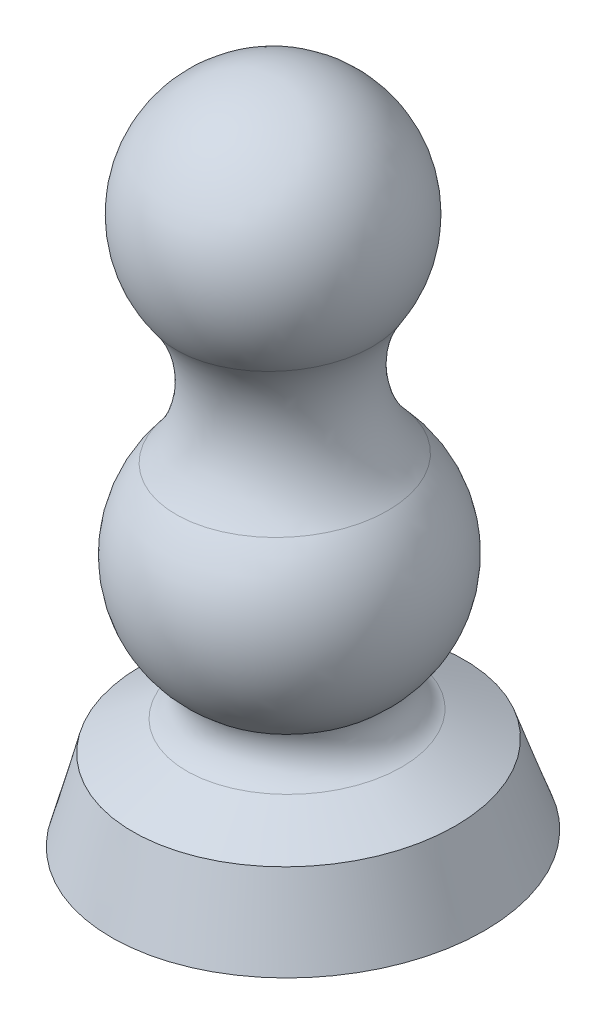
from build123d import *


with BuildPart() as part:
    # Sketch1 → Revolve2 (revolve)
    with BuildSketch(Plane.XY, mode=Mode.PRIVATE) as revolve2_sk:
        with BuildLine():
            Line((0, 0), (-54.257376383, 0))
            Line((-54.257376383, 0), (-48.243520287, 23.54599939))
            Line((-48.243520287, 23.54599939), (-33.140284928, 32.503826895))
            ThreePointArc((-33.140284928, 32.503826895), (-28.797207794, 37.779024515), (-28.828342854, 44.61196382))
            ThreePointArc((-28.828342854, 44.61196382), (-44.154984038, 68.993665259), (-36.303047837, 96.701432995))
            ThreePointArc((-36.303047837, 96.701432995), (-29.003685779, 116.860307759), (-36.303047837, 137.019182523))
            ThreePointArc((-36.303047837, 137.019182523), (-41.585005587, 173.799587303), (-11.108962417, 195.057716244))
            Line((-11.108962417, 195.057716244), (0, 0))
        make_face()
    revolve(revolve2_sk.sketch.rotate(Axis((0, 0, 0), (-0.05686004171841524, 0.9983821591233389, 0)), 180), axis=Axis((0, 0, 0), (-0.05686004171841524, 0.9983821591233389, 0)))


solid = part.part
